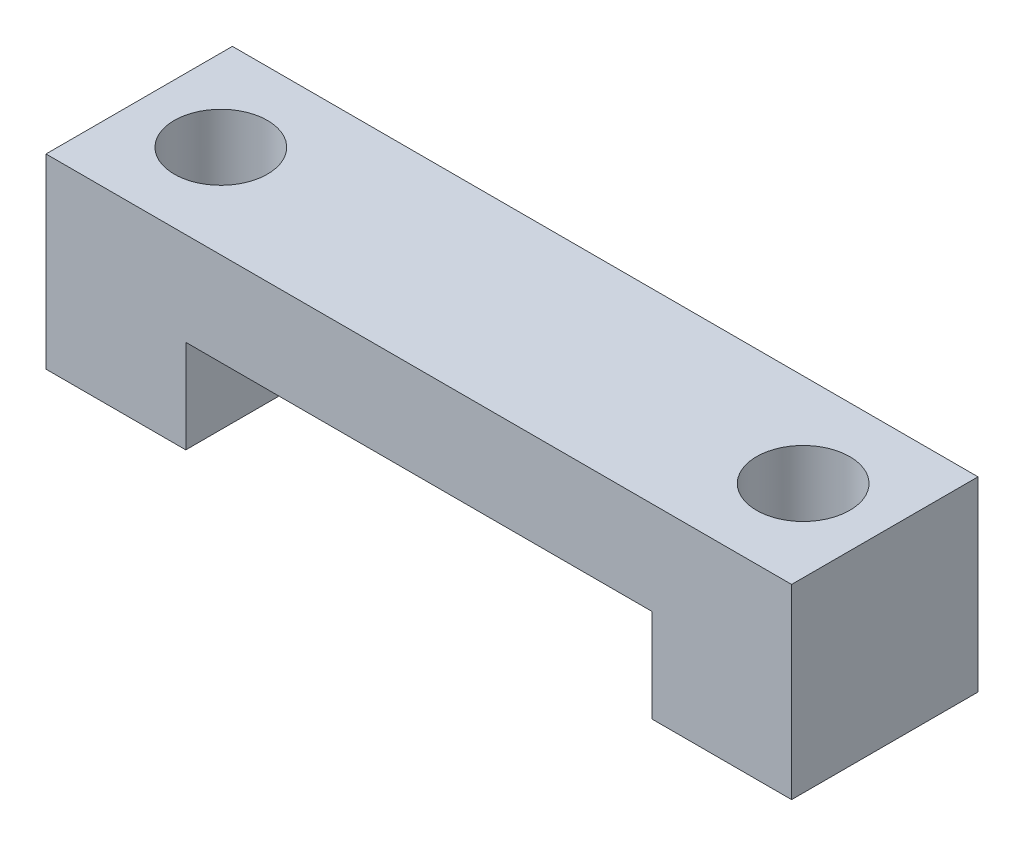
ISO-10303-21;
HEADER;
FILE_DESCRIPTION(('STEP AP214'),'2;1');
FILE_NAME('part.step','',(''),(''),'','','');
FILE_SCHEMA(('AUTOMOTIVE_DESIGN { 1 0 10303 214 1 1 1 1 }'));
ENDSEC;
DATA;
#1=APPLICATION_CONTEXT('core data for automotive mechanical design processes');
#2=APPLICATION_PROTOCOL_DEFINITION('international standard','automotive_design',2000,#1);
#3=PRODUCT_CONTEXT('',#1,'mechanical');
#4=PRODUCT('Part','Part','',(#3));
#5=PRODUCT_RELATED_PRODUCT_CATEGORY('part','',(#4));
#6=PRODUCT_DEFINITION_FORMATION('','',#4);
#7=PRODUCT_DEFINITION_CONTEXT('part definition',#1,'design');
#8=PRODUCT_DEFINITION('design','',#6,#7);
#9=PRODUCT_DEFINITION_SHAPE('','',#8);
#10=(LENGTH_UNIT() NAMED_UNIT(*) SI_UNIT(.MILLI.,.METRE.));
#11=(NAMED_UNIT(*) PLANE_ANGLE_UNIT() SI_UNIT($,.RADIAN.));
#12=(NAMED_UNIT(*) SI_UNIT($,.STERADIAN.) SOLID_ANGLE_UNIT());
#13=UNCERTAINTY_MEASURE_WITH_UNIT(LENGTH_MEASURE(1.E-05),#10,'distance_accuracy_value','');
#14=(GEOMETRIC_REPRESENTATION_CONTEXT(3) GLOBAL_UNCERTAINTY_ASSIGNED_CONTEXT((#13)) GLOBAL_UNIT_ASSIGNED_CONTEXT((#10,
#11,#12)) REPRESENTATION_CONTEXT('',''));
#15=CARTESIAN_POINT('',(0.,0.,0.));
#16=DIRECTION('',(0.,0.,1.));
#17=DIRECTION('',(1.,0.,0.));
#18=AXIS2_PLACEMENT_3D('',#15,#16,#17);
#19=CARTESIAN_POINT('',(-25.4,12.7,6.35));
#20=DIRECTION('',(0.,-1.,0.));
#21=DIRECTION('',(0.,0.,-1.));
#22=AXIS2_PLACEMENT_3D('',#19,#20,#21);
#23=PLANE('',#22);
#24=CARTESIAN_POINT('',(-19.8374,12.7,0.));
#25=DIRECTION('',(0.,-1.,0.));
#26=DIRECTION('',(0.,0.,-1.));
#27=AXIS2_PLACEMENT_3D('',#24,#25,#26);
#28=CIRCLE('',#27,3.175);
#29=CARTESIAN_POINT('',(-19.8374,12.7,-3.175));
#30=VERTEX_POINT('',#29);
#31=EDGE_CURVE('E146',#30,#30,#28,.F.);
#32=ORIENTED_EDGE('',*,*,#31,.F.);
#33=EDGE_LOOP('',(#32));
#34=FACE_BOUND('',#33,.T.);
#35=DIRECTION('',(-1.,0.,0.));
#36=VECTOR('',#35,1.);
#37=CARTESIAN_POINT('',(-25.4,12.7,-6.35));
#38=LINE('',#37,#36);
#39=CARTESIAN_POINT('',(25.4,12.7,-6.35));
#40=VERTEX_POINT('',#39);
#41=CARTESIAN_POINT('',(-25.4,12.7,-6.35));
#42=VERTEX_POINT('',#41);
#43=EDGE_CURVE('E132',#40,#42,#38,.T.);
#44=ORIENTED_EDGE('',*,*,#43,.T.);
#45=DIRECTION('',(0.,0.,-1.));
#46=VECTOR('',#45,1.);
#47=CARTESIAN_POINT('',(-25.4,12.7,6.35));
#48=LINE('',#47,#46);
#49=CARTESIAN_POINT('',(-25.4,12.7,6.35));
#50=VERTEX_POINT('',#49);
#51=EDGE_CURVE('E129',#50,#42,#48,.T.);
#52=ORIENTED_EDGE('',*,*,#51,.F.);
#53=DIRECTION('',(-1.,0.,0.));
#54=VECTOR('',#53,1.);
#55=CARTESIAN_POINT('',(-25.4,12.7,6.35));
#56=LINE('',#55,#54);
#57=CARTESIAN_POINT('',(25.4,12.7,6.35));
#58=VERTEX_POINT('',#57);
#59=EDGE_CURVE('E118',#58,#50,#56,.T.);
#60=ORIENTED_EDGE('',*,*,#59,.F.);
#61=DIRECTION('',(0.,0.,-1.));
#62=VECTOR('',#61,1.);
#63=CARTESIAN_POINT('',(25.4,12.7,6.35));
#64=LINE('',#63,#62);
#65=EDGE_CURVE('E133',#58,#40,#64,.T.);
#66=ORIENTED_EDGE('',*,*,#65,.T.);
#67=EDGE_LOOP('',(#44,#52,#60,#66));
#68=FACE_BOUND('',#67,.T.);
#69=CARTESIAN_POINT('',(19.8374,12.7,0.));
#70=DIRECTION('',(0.,-1.,0.));
#71=DIRECTION('',(0.,0.,-1.));
#72=AXIS2_PLACEMENT_3D('',#69,#70,#71);
#73=CIRCLE('',#72,3.175);
#74=CARTESIAN_POINT('',(19.8374,12.7,-3.175));
#75=VERTEX_POINT('',#74);
#76=EDGE_CURVE('E196',#75,#75,#73,.F.);
#77=ORIENTED_EDGE('',*,*,#76,.F.);
#78=EDGE_LOOP('',(#77));
#79=FACE_BOUND('',#78,.T.);
#80=ADVANCED_FACE('F45',(#34,#68,#79),#23,.F.);
#81=CARTESIAN_POINT('',(25.4,0.,6.35));
#82=DIRECTION('',(0.,1.,0.));
#83=DIRECTION('',(-1.,0.,0.));
#84=AXIS2_PLACEMENT_3D('',#81,#82,#83);
#85=PLANE('',#84);
#86=DIRECTION('',(1.,0.,0.));
#87=VECTOR('',#86,1.);
#88=CARTESIAN_POINT('',(25.4,0.,-6.35));
#89=LINE('',#88,#87);
#90=CARTESIAN_POINT('',(15.875,0.,-6.35));
#91=VERTEX_POINT('',#90);
#92=CARTESIAN_POINT('',(25.4,0.,-6.35));
#93=VERTEX_POINT('',#92);
#94=EDGE_CURVE('E150',#91,#93,#89,.T.);
#95=ORIENTED_EDGE('',*,*,#94,.T.);
#96=DIRECTION('',(0.,0.,-1.));
#97=VECTOR('',#96,1.);
#98=CARTESIAN_POINT('',(25.4,0.,6.35));
#99=LINE('',#98,#97);
#100=CARTESIAN_POINT('',(25.4,0.,6.35));
#101=VERTEX_POINT('',#100);
#102=EDGE_CURVE('E161',#101,#93,#99,.T.);
#103=ORIENTED_EDGE('',*,*,#102,.F.);
#104=DIRECTION('',(1.,0.,0.));
#105=VECTOR('',#104,1.);
#106=CARTESIAN_POINT('',(25.4,0.,6.35));
#107=LINE('',#106,#105);
#108=CARTESIAN_POINT('',(15.875,0.,6.35));
#109=VERTEX_POINT('',#108);
#110=EDGE_CURVE('E185',#109,#101,#107,.T.);
#111=ORIENTED_EDGE('',*,*,#110,.F.);
#112=DIRECTION('',(0.,0.,-1.));
#113=VECTOR('',#112,1.);
#114=CARTESIAN_POINT('',(15.875,0.,6.35));
#115=LINE('',#114,#113);
#116=EDGE_CURVE('E164',#109,#91,#115,.T.);
#117=ORIENTED_EDGE('',*,*,#116,.T.);
#118=EDGE_LOOP('',(#95,#103,#111,#117));
#119=FACE_BOUND('',#118,.T.);
#120=CARTESIAN_POINT('',(19.8374,0.,0.));
#121=DIRECTION('',(0.,1.,0.));
#122=DIRECTION('',(0.,0.,1.));
#123=AXIS2_PLACEMENT_3D('',#120,#121,#122);
#124=CIRCLE('',#123,3.175);
#125=CARTESIAN_POINT('',(19.8374,0.,3.175));
#126=VERTEX_POINT('',#125);
#127=EDGE_CURVE('E199',#126,#126,#124,.T.);
#128=ORIENTED_EDGE('',*,*,#127,.T.);
#129=EDGE_LOOP('',(#128));
#130=FACE_BOUND('',#129,.T.);
#131=ADVANCED_FACE('F180',(#119,#130),#85,.F.);
#132=CARTESIAN_POINT('',(-15.875,0.,6.35));
#133=DIRECTION('',(0.,1.,0.));
#134=DIRECTION('',(-1.,0.,0.));
#135=AXIS2_PLACEMENT_3D('',#132,#133,#134);
#136=PLANE('',#135);
#137=DIRECTION('',(1.,0.,0.));
#138=VECTOR('',#137,1.);
#139=CARTESIAN_POINT('',(-15.875,0.,-6.35));
#140=LINE('',#139,#138);
#141=CARTESIAN_POINT('',(-25.4,0.,-6.35));
#142=VERTEX_POINT('',#141);
#143=CARTESIAN_POINT('',(-15.875,0.,-6.35));
#144=VERTEX_POINT('',#143);
#145=EDGE_CURVE('E97',#142,#144,#140,.T.);
#146=ORIENTED_EDGE('',*,*,#145,.T.);
#147=DIRECTION('',(0.,0.,-1.));
#148=VECTOR('',#147,1.);
#149=CARTESIAN_POINT('',(-15.875,0.,6.35));
#150=LINE('',#149,#148);
#151=CARTESIAN_POINT('',(-15.875,0.,6.35));
#152=VERTEX_POINT('',#151);
#153=EDGE_CURVE('E138',#152,#144,#150,.T.);
#154=ORIENTED_EDGE('',*,*,#153,.F.);
#155=DIRECTION('',(1.,0.,0.));
#156=VECTOR('',#155,1.);
#157=CARTESIAN_POINT('',(-15.875,0.,6.35));
#158=LINE('',#157,#156);
#159=CARTESIAN_POINT('',(-25.4,0.,6.35));
#160=VERTEX_POINT('',#159);
#161=EDGE_CURVE('E62',#160,#152,#158,.T.);
#162=ORIENTED_EDGE('',*,*,#161,.F.);
#163=DIRECTION('',(0.,0.,-1.));
#164=VECTOR('',#163,1.);
#165=CARTESIAN_POINT('',(-25.4,0.,6.35));
#166=LINE('',#165,#164);
#167=EDGE_CURVE('E134',#160,#142,#166,.T.);
#168=ORIENTED_EDGE('',*,*,#167,.T.);
#169=EDGE_LOOP('',(#146,#154,#162,#168));
#170=FACE_BOUND('',#169,.T.);
#171=CARTESIAN_POINT('',(-19.8374,0.,0.));
#172=DIRECTION('',(0.,1.,0.));
#173=DIRECTION('',(0.,0.,1.));
#174=AXIS2_PLACEMENT_3D('',#171,#172,#173);
#175=CIRCLE('',#174,3.175);
#176=CARTESIAN_POINT('',(-19.8374,0.,3.175));
#177=VERTEX_POINT('',#176);
#178=EDGE_CURVE('E193',#177,#177,#175,.T.);
#179=ORIENTED_EDGE('',*,*,#178,.T.);
#180=EDGE_LOOP('',(#179));
#181=FACE_BOUND('',#180,.T.);
#182=ADVANCED_FACE('F215',(#170,#181),#136,.F.);
#183=CARTESIAN_POINT('',(-15.875,6.35,6.35));
#184=DIRECTION('',(-1.,0.,0.));
#185=DIRECTION('',(0.,0.,1.));
#186=AXIS2_PLACEMENT_3D('',#183,#184,#185);
#187=PLANE('',#186);
#188=DIRECTION('',(0.,1.,0.));
#189=VECTOR('',#188,1.);
#190=CARTESIAN_POINT('',(-15.875,6.35,-6.35));
#191=LINE('',#190,#189);
#192=CARTESIAN_POINT('',(-15.875,6.35,-6.35));
#193=VERTEX_POINT('',#192);
#194=EDGE_CURVE('E142',#144,#193,#191,.T.);
#195=ORIENTED_EDGE('',*,*,#194,.T.);
#196=DIRECTION('',(0.,0.,-1.));
#197=VECTOR('',#196,1.);
#198=CARTESIAN_POINT('',(-15.875,6.35,6.35));
#199=LINE('',#198,#197);
#200=CARTESIAN_POINT('',(-15.875,6.35,6.35));
#201=VERTEX_POINT('',#200);
#202=EDGE_CURVE('E13',#201,#193,#199,.T.);
#203=ORIENTED_EDGE('',*,*,#202,.F.);
#204=DIRECTION('',(0.,1.,0.));
#205=VECTOR('',#204,1.);
#206=CARTESIAN_POINT('',(-15.875,6.35,6.35));
#207=LINE('',#206,#205);
#208=EDGE_CURVE('E157',#152,#201,#207,.T.);
#209=ORIENTED_EDGE('',*,*,#208,.F.);
#210=ORIENTED_EDGE('',*,*,#153,.T.);
#211=EDGE_LOOP('',(#195,#203,#209,#210));
#212=FACE_BOUND('',#211,.T.);
#213=ADVANCED_FACE('F47',(#212),#187,.F.);
#214=CARTESIAN_POINT('',(15.875,6.35,6.35));
#215=DIRECTION('',(0.,1.,0.));
#216=DIRECTION('',(0.,0.,1.));
#217=AXIS2_PLACEMENT_3D('',#214,#215,#216);
#218=PLANE('',#217);
#219=DIRECTION('',(1.,0.,0.));
#220=VECTOR('',#219,1.);
#221=CARTESIAN_POINT('',(15.875,6.35,-6.35));
#222=LINE('',#221,#220);
#223=CARTESIAN_POINT('',(15.875,6.35,-6.35));
#224=VERTEX_POINT('',#223);
#225=EDGE_CURVE('E145',#193,#224,#222,.T.);
#226=ORIENTED_EDGE('',*,*,#225,.T.);
#227=DIRECTION('',(0.,0.,-1.));
#228=VECTOR('',#227,1.);
#229=CARTESIAN_POINT('',(15.875,6.35,6.35));
#230=LINE('',#229,#228);
#231=CARTESIAN_POINT('',(15.875,6.35,6.35));
#232=VERTEX_POINT('',#231);
#233=EDGE_CURVE('E54',#232,#224,#230,.T.);
#234=ORIENTED_EDGE('',*,*,#233,.F.);
#235=DIRECTION('',(1.,0.,0.));
#236=VECTOR('',#235,1.);
#237=CARTESIAN_POINT('',(15.875,6.35,6.35));
#238=LINE('',#237,#236);
#239=EDGE_CURVE('E105',#201,#232,#238,.T.);
#240=ORIENTED_EDGE('',*,*,#239,.F.);
#241=ORIENTED_EDGE('',*,*,#202,.T.);
#242=EDGE_LOOP('',(#226,#234,#240,#241));
#243=FACE_BOUND('',#242,.T.);
#244=ADVANCED_FACE('F224',(#243),#218,.F.);
#245=CARTESIAN_POINT('',(15.875,0.,6.35));
#246=DIRECTION('',(1.,0.,0.));
#247=DIRECTION('',(0.,0.,-1.));
#248=AXIS2_PLACEMENT_3D('',#245,#246,#247);
#249=PLANE('',#248);
#250=DIRECTION('',(0.,-1.,0.));
#251=VECTOR('',#250,1.);
#252=CARTESIAN_POINT('',(15.875,0.,-6.35));
#253=LINE('',#252,#251);
#254=EDGE_CURVE('E148',#224,#91,#253,.T.);
#255=ORIENTED_EDGE('',*,*,#254,.T.);
#256=ORIENTED_EDGE('',*,*,#116,.F.);
#257=DIRECTION('',(0.,-1.,0.));
#258=VECTOR('',#257,1.);
#259=CARTESIAN_POINT('',(15.875,0.,6.35));
#260=LINE('',#259,#258);
#261=EDGE_CURVE('E172',#232,#109,#260,.T.);
#262=ORIENTED_EDGE('',*,*,#261,.F.);
#263=ORIENTED_EDGE('',*,*,#233,.T.);
#264=EDGE_LOOP('',(#255,#256,#262,#263));
#265=FACE_BOUND('',#264,.T.);
#266=ADVANCED_FACE('F170',(#265),#249,.F.);
#267=CARTESIAN_POINT('',(25.4,12.7,6.35));
#268=DIRECTION('',(-1.,0.,0.));
#269=DIRECTION('',(0.,0.,1.));
#270=AXIS2_PLACEMENT_3D('',#267,#268,#269);
#271=PLANE('',#270);
#272=DIRECTION('',(0.,1.,0.));
#273=VECTOR('',#272,1.);
#274=CARTESIAN_POINT('',(25.4,12.7,-6.35));
#275=LINE('',#274,#273);
#276=EDGE_CURVE('E152',#93,#40,#275,.T.);
#277=ORIENTED_EDGE('',*,*,#276,.T.);
#278=ORIENTED_EDGE('',*,*,#65,.F.);
#279=DIRECTION('',(0.,1.,0.));
#280=VECTOR('',#279,1.);
#281=CARTESIAN_POINT('',(25.4,12.7,6.35));
#282=LINE('',#281,#280);
#283=EDGE_CURVE('E124',#101,#58,#282,.T.);
#284=ORIENTED_EDGE('',*,*,#283,.F.);
#285=ORIENTED_EDGE('',*,*,#102,.T.);
#286=EDGE_LOOP('',(#277,#278,#284,#285));
#287=FACE_BOUND('',#286,.T.);
#288=ADVANCED_FACE('F184',(#287),#271,.F.);
#289=CARTESIAN_POINT('',(-25.4,0.,6.35));
#290=DIRECTION('',(1.,0.,0.));
#291=DIRECTION('',(0.,0.,-1.));
#292=AXIS2_PLACEMENT_3D('',#289,#290,#291);
#293=PLANE('',#292);
#294=DIRECTION('',(0.,-1.,0.));
#295=VECTOR('',#294,1.);
#296=CARTESIAN_POINT('',(-25.4,0.,-6.35));
#297=LINE('',#296,#295);
#298=EDGE_CURVE('E91',#42,#142,#297,.T.);
#299=ORIENTED_EDGE('',*,*,#298,.T.);
#300=ORIENTED_EDGE('',*,*,#167,.F.);
#301=DIRECTION('',(0.,-1.,0.));
#302=VECTOR('',#301,1.);
#303=CARTESIAN_POINT('',(-25.4,0.,6.35));
#304=LINE('',#303,#302);
#305=EDGE_CURVE('E122',#50,#160,#304,.T.);
#306=ORIENTED_EDGE('',*,*,#305,.F.);
#307=ORIENTED_EDGE('',*,*,#51,.T.);
#308=EDGE_LOOP('',(#299,#300,#306,#307));
#309=FACE_BOUND('',#308,.T.);
#310=ADVANCED_FACE('F136',(#309),#293,.F.);
#311=CARTESIAN_POINT('',(0.,0.,6.35));
#312=DIRECTION('',(0.,0.,-1.));
#313=DIRECTION('',(-1.,0.,0.));
#314=AXIS2_PLACEMENT_3D('',#311,#312,#313);
#315=PLANE('',#314);
#316=ORIENTED_EDGE('',*,*,#208,.T.);
#317=ORIENTED_EDGE('',*,*,#239,.T.);
#318=ORIENTED_EDGE('',*,*,#261,.T.);
#319=ORIENTED_EDGE('',*,*,#110,.T.);
#320=ORIENTED_EDGE('',*,*,#283,.T.);
#321=ORIENTED_EDGE('',*,*,#59,.T.);
#322=ORIENTED_EDGE('',*,*,#305,.T.);
#323=ORIENTED_EDGE('',*,*,#161,.T.);
#324=EDGE_LOOP('',(#316,#317,#318,#319,#320,#321,#322,#323));
#325=FACE_BOUND('',#324,.T.);
#326=ADVANCED_FACE('F120',(#325),#315,.F.);
#327=CARTESIAN_POINT('',(0.,0.,-6.35));
#328=DIRECTION('',(0.,0.,-1.));
#329=DIRECTION('',(-1.,0.,0.));
#330=AXIS2_PLACEMENT_3D('',#327,#328,#329);
#331=PLANE('',#330);
#332=ORIENTED_EDGE('',*,*,#194,.F.);
#333=ORIENTED_EDGE('',*,*,#145,.F.);
#334=ORIENTED_EDGE('',*,*,#298,.F.);
#335=ORIENTED_EDGE('',*,*,#43,.F.);
#336=ORIENTED_EDGE('',*,*,#276,.F.);
#337=ORIENTED_EDGE('',*,*,#94,.F.);
#338=ORIENTED_EDGE('',*,*,#254,.F.);
#339=ORIENTED_EDGE('',*,*,#225,.F.);
#340=EDGE_LOOP('',(#332,#333,#334,#335,#336,#337,#338,#339));
#341=FACE_BOUND('',#340,.T.);
#342=ADVANCED_FACE('F176',(#341),#331,.T.);
#343=CARTESIAN_POINT('',(-19.8374,25.4,0.));
#344=DIRECTION('',(0.,-1.,0.));
#345=DIRECTION('',(0.,0.,-1.));
#346=AXIS2_PLACEMENT_3D('',#343,#344,#345);
#347=CYLINDRICAL_SURFACE('',#346,3.175);
#348=ORIENTED_EDGE('',*,*,#178,.F.);
#349=EDGE_LOOP('',(#348));
#350=FACE_BOUND('',#349,.T.);
#351=ORIENTED_EDGE('',*,*,#31,.T.);
#352=EDGE_LOOP('',(#351));
#353=FACE_BOUND('',#352,.T.);
#354=ADVANCED_FACE('F206',(#350,#353),#347,.F.);
#355=CARTESIAN_POINT('',(19.8374,25.4,0.));
#356=DIRECTION('',(0.,-1.,0.));
#357=DIRECTION('',(0.,0.,-1.));
#358=AXIS2_PLACEMENT_3D('',#355,#356,#357);
#359=CYLINDRICAL_SURFACE('',#358,3.175);
#360=ORIENTED_EDGE('',*,*,#127,.F.);
#361=EDGE_LOOP('',(#360));
#362=FACE_BOUND('',#361,.T.);
#363=ORIENTED_EDGE('',*,*,#76,.T.);
#364=EDGE_LOOP('',(#363));
#365=FACE_BOUND('',#364,.T.);
#366=ADVANCED_FACE('F203',(#362,#365),#359,.F.);
#367=CLOSED_SHELL('',(#80,#131,#182,#213,#244,#266,#288,#310,#326,#342,#354,#366));
#368=MANIFOLD_SOLID_BREP('B2',#367);
#369=ADVANCED_BREP_SHAPE_REPRESENTATION('',(#18,#368),#14);
#370=SHAPE_DEFINITION_REPRESENTATION(#9,#369);
ENDSEC;
END-ISO-10303-21;
